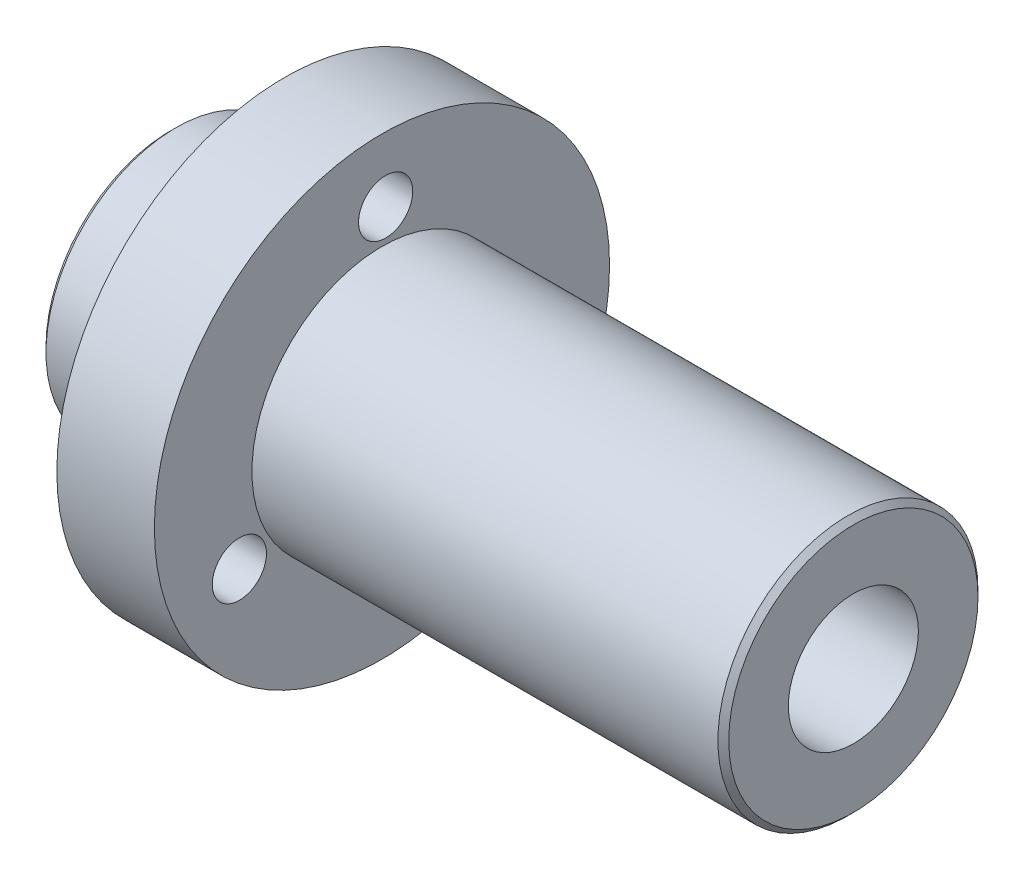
from build123d import *

# Parameters (mm, degrees)
ESQUISSE1_W                      = 18
ESQUISSE1_H                      = 42
ESQUISSE2_R                      = 24
EXTRUSION1_DEPTH                 = 21
EXTRUSION2_START                 = 87
ESQUISSE3_R                      = 24
EXTRUSION2_DEPTH                 = 87
DIAM_TRE_DU_PER_AGE_M10_0_10_1_D = 10
DIAM_TRE_DU_PER_AGE_M10_0_10_2_D = 10
DIAM_TRE_DU_PER_AGE_M10_0_10_3_D = 10
PER_AGE1_D                       = 24
PER_AGE1_CBORE_D                 = 36
PER_AGE1_CBORE_DEPTH             = 99
CHANFREIN1_SIZE                  = 1


with BuildPart() as part:
    # Esquisse1 → R_volution1 (revolve)
    with BuildSketch(Plane.XY, mode=Mode.PRIVATE) as r_volution1_sk:
        with Locations((30, 21)):
            Rectangle(ESQUISSE1_W, ESQUISSE1_H)
    revolve(r_volution1_sk.sketch.rotate(Axis((21, 0, 0), (1, 0, 0)), 270), axis=Axis((21, 0, 0), (1, 0, 0)))

    # Esquisse2 → Extrusion1 (add)
    with BuildSketch(Plane.ZY.offset(-21)):
        with Locations(Location((0, 0, 0), (0, 0, 180))):
            Circle(ESQUISSE2_R)
    extrude(amount=EXTRUSION1_DEPTH)

    # Esquisse3 → Extrusion2 (add)
    with BuildSketch(Plane(origin=(39, 0, 0), x_dir=(0, 0, -1), z_dir=(1, 0, 0)).offset(EXTRUSION2_START)):
        Circle(ESQUISSE3_R)
    extrude(amount=-EXTRUSION2_DEPTH)

    # Diam_tre du per_age M10.0 _10_1 (through all)
    with Locations(Plane(origin=(39, 0, 0), x_dir=(0, 0, -1), z_dir=(1, 0, 0))):
        with Locations((25.633132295, -15.586613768)):
            Hole(DIAM_TRE_DU_PER_AGE_M10_0_10_1_D / 2)

    # Diam_tre du per_age M10.0 _10_2 (through all)
    with Locations(Plane(origin=(39, 0, 0), x_dir=(0, 0, -1), z_dir=(1, 0, 0))):
        with Locations((0.681837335, 29.99225063)):
            Hole(DIAM_TRE_DU_PER_AGE_M10_0_10_2_D / 2)

    # Diam_tre du per_age M10.0 _10_3 (through all)
    with Locations(Plane(origin=(39, 0, 0), x_dir=(0, 0, -1), z_dir=(1, 0, 0))):
        with Locations((-26.31496963, -14.405636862)):
            Hole(DIAM_TRE_DU_PER_AGE_M10_0_10_3_D / 2)

    # Per_age1 (through all)
    with Locations(Plane.ZY):
        with Locations((0, 0)):
            CounterBoreHole(PER_AGE1_D / 2, PER_AGE1_CBORE_D / 2, PER_AGE1_CBORE_DEPTH)

    # Chanfrein1
    chanfrein1_edges = [part.edges().sort_by_distance(p)[0] for p in [
        (126, 0, 24),
        (0, 0, 24),
    ]]
    chamfer(chanfrein1_edges, length=CHANFREIN1_SIZE)


solid = part.part
